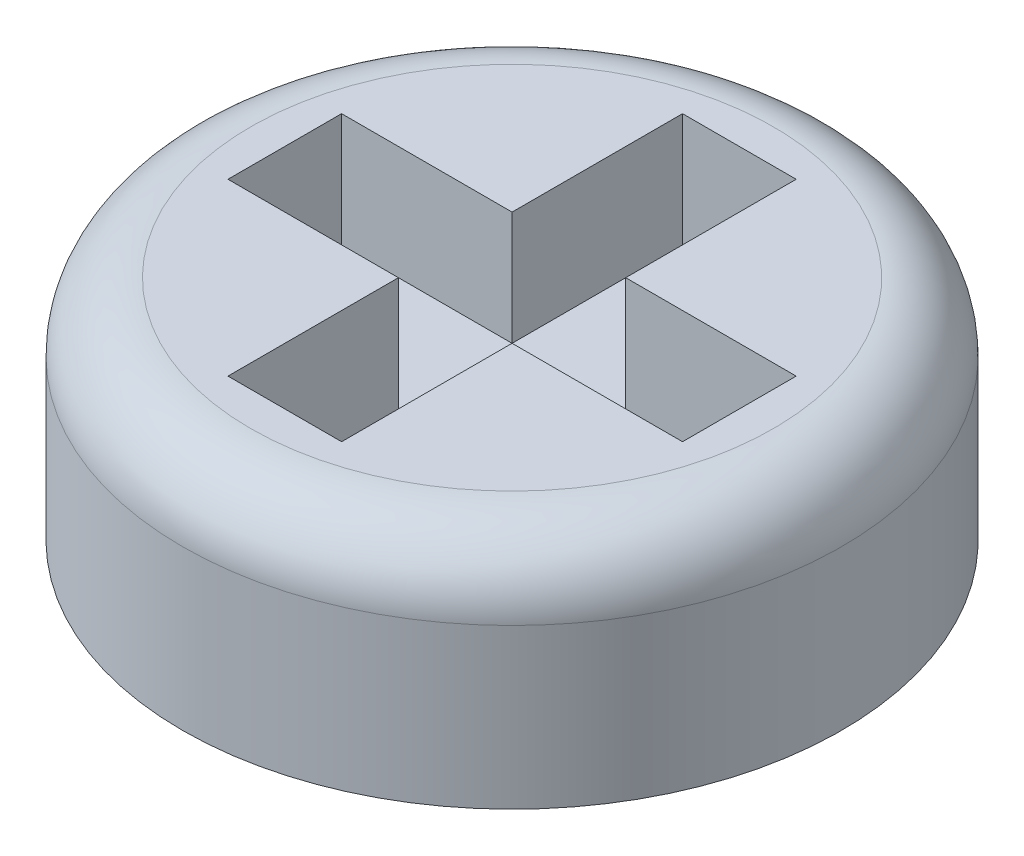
from build123d import *

# Parameters (mm, degrees)
SKETCH1_R           = 1.45
BOSS_EXTRUDE1_DEPTH = 1
CUT_EXTRUDE1_DEPTH  = 0.5
FILLET3_R           = 0.3


with BuildPart() as part:
    # Sketch1 → Boss-Extrude1 (new body)
    with BuildSketch(Plane(origin=(0, 0, 0), x_dir=(1, 0, 0), z_dir=(0, 1, 0))):
        with Locations(Location((0, 0, 0), (0, 0, 270))):
            Circle(SKETCH1_R)
    extrude(amount=BOSS_EXTRUDE1_DEPTH)

    # Sketch2 → Cut-Extrude1 (cut)
    with BuildSketch(Plane(origin=(0, 1, 0), x_dir=(1, 0, 0), z_dir=(0, 1, 0))):
        Polygon((-0.25, 0.25), (-0.25, 1), (0.25, 1), (0.25, 0.25), (1, 0.25), (1, -0.25), (0.25, -0.25), (0.25, -1), (-0.25, -1), (-0.25, -0.25), (-1, -0.25), (-1, 0.25), align=None)
    extrude(amount=-CUT_EXTRUDE1_DEPTH, mode=Mode.SUBTRACT)

    # Fillet3
    fillet3_edges = [part.edges().sort_by_distance(p)[0] for p in [
        (0, 1, -1.45),
    ]]
    fillet(fillet3_edges, radius=FILLET3_R)


solid = part.part
